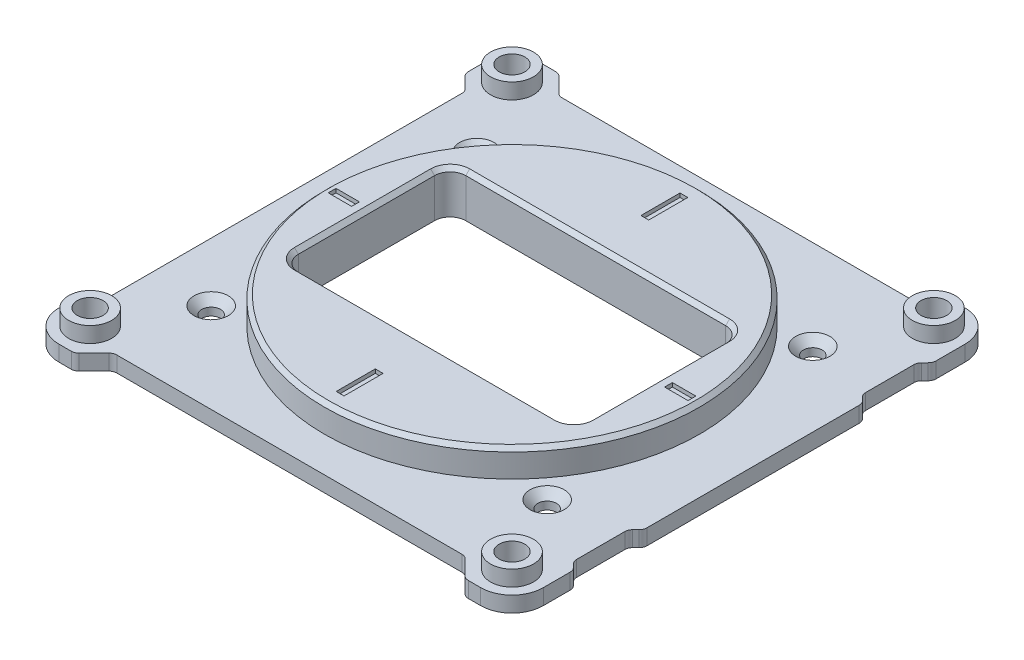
from build123d import *

# Parameters (mm, degrees)
BOSS_EXTRUDE1_DEPTH                            = 2
SKETCH1_R                                      = 24
BOSS_EXTRUDE2_DEPTH                            = 3.5
CUT_EXTRUDE1_REACH                             = 51.284
SKETCH6_R                                      = 2.75
BOSS_EXTRUDE3_DEPTH                            = 2
M4X0_7_TAPPED_HOLE1_D                          = 3.3
M4X0_7_TAPPED_HOLE1_DEPTH                      = 4
M4X0_7_TAPPED_HOLE1_TIP                        = 0.991420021
CSK_FOR_M2_FLAT_HEAD_MACHINE_SCREW1_AT_2_COUNT = 2
CSK_FOR_M2_FLAT_HEAD_MACHINE_SCREW1_AT_2_PITCH = 43
CSK_FOR_M2_FLAT_HEAD_MACHINE_SCREW1_AT_3_COUNT = 2
CSK_FOR_M2_FLAT_HEAD_MACHINE_SCREW1_AT_3_PITCH = 54.817880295
CSK_FOR_M2_FLAT_HEAD_MACHINE_SCREW1_AT_4_COUNT = 2
CSK_FOR_M2_FLAT_HEAD_MACHINE_SCREW1_AT_4_PITCH = 34
SKETCH14_W                                     = 3
SKETCH14_H                                     = 1
SKETCH14_W_2                                   = 1
SKETCH14_H_2                                   = 5
CUT_EXTRUDE2_DEPTH                             = 0.5
CHAMFER1_SIZE                                  = 0.5


with BuildPart() as part:
    # Top Plate Outline → Boss-Extrude1 (new body)
    with BuildSketch(Plane(origin=(0, 0, 0), x_dir=(1, 0, 0), z_dir=(0, 1, 0))):
        with BuildLine():
            Line((17.100061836, 30.232739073), (19.014275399, 32.146952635))
            ThreePointArc((19.014275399, 32.146952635), (19.338698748, 32.363725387), (19.72138218, 32.439845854))
            Line((19.72138218, 32.439845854), (21.307168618, 32.439845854))
            ThreePointArc((21.307168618, 32.439845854), (24.135595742, 31.268272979), (25.307168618, 28.439845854))
            Line((25.307168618, 28.439845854), (25.307168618, 24.714394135))
            ThreePointArc((25.307168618, 24.714394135), (25.23104815, 24.331710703), (25.014275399, 24.007287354))
            Line((25.014275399, 24.007287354), (24.600061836, 23.593073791))
            ThreePointArc((24.600061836, 23.593073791), (24.383289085, 23.268650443), (24.307168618, 22.88596701))
            Line((24.307168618, 22.88596701), (24.307168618, 16.714394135))
            ThreePointArc((24.307168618, 16.714394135), (24.383289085, 16.331710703), (24.600061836, 16.007287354))
            Line((24.600061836, 16.007287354), (25.014275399, 15.593073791))
            ThreePointArc((25.014275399, 15.593073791), (25.23104815, 15.268650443), (25.307168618, 14.88596701))
            Line((25.307168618, 14.88596701), (25.307168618, -12.285605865))
            ThreePointArc((25.307168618, -12.285605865), (25.23104815, -12.668289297), (25.014275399, -12.992712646))
            Line((25.014275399, -12.992712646), (24.600061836, -13.406926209))
            ThreePointArc((24.600061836, -13.406926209), (24.383289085, -13.731349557), (24.307168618, -14.11403299))
            Line((24.307168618, -14.11403299), (24.307168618, -20.285605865))
            ThreePointArc((24.307168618, -20.285605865), (24.383289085, -20.668289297), (24.600061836, -20.992712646))
            Line((24.600061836, -20.992712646), (25.014275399, -21.406926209))
            ThreePointArc((25.014275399, -21.406926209), (25.23104815, -21.731349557), (25.307168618, -22.11403299))
            Line((25.307168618, -22.11403299), (25.307168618, -25.560154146))
            ThreePointArc((25.307168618, -25.560154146), (24.135595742, -28.38858127), (21.307168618, -29.560154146))
            Line((21.307168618, -29.560154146), (19.72138218, -29.560154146))
            ThreePointArc((19.72138218, -29.560154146), (19.338698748, -29.484033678), (19.014275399, -29.267260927))
            Line((19.014275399, -29.267260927), (17.100061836, -27.353047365))
            ThreePointArc((17.100061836, -27.353047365), (16.775638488, -27.136274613), (16.392955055, -27.060154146))
            Line((16.392955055, -27.060154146), (-27.77861782, -27.060154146))
            ThreePointArc((-27.77861782, -27.060154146), (-28.161301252, -27.136274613), (-28.485724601, -27.353047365))
            Line((-28.485724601, -27.353047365), (-30.399938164, -29.267260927))
            ThreePointArc((-30.399938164, -29.267260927), (-30.724361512, -29.484033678), (-31.107044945, -29.560154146))
            Line((-31.107044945, -29.560154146), (-32.692831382, -29.560154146))
            ThreePointArc((-32.692831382, -29.560154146), (-35.521258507, -28.38858127), (-36.692831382, -25.560154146))
            Line((-36.692831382, -25.560154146), (-36.692831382, -23.974367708))
            ThreePointArc((-36.692831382, -23.974367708), (-36.616710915, -23.591684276), (-36.399938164, -23.267260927))
            Line((-36.399938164, -23.267260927), (-34.985724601, -21.853047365))
            ThreePointArc((-34.985724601, -21.853047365), (-34.76895185, -21.528624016), (-34.692831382, -21.145940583))
            Line((-34.692831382, -21.145940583), (-34.692831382, 24.025632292))
            ThreePointArc((-34.692831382, 24.025632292), (-34.76895185, 24.408315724), (-34.985724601, 24.732739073))
            Line((-34.985724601, 24.732739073), (-36.399938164, 26.146952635))
            ThreePointArc((-36.399938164, 26.146952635), (-36.616710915, 26.471375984), (-36.692831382, 26.854059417))
            Line((-36.692831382, 26.854059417), (-36.692831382, 28.439845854))
            ThreePointArc((-36.692831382, 28.439845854), (-35.521258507, 31.268272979), (-32.692831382, 32.439845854))
            Line((-32.692831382, 32.439845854), (-31.107044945, 32.439845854))
            ThreePointArc((-31.107044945, 32.439845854), (-30.724361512, 32.363725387), (-30.399938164, 32.146952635))
            Line((-30.399938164, 32.146952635), (-28.485724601, 30.232739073))
            ThreePointArc((-28.485724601, 30.232739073), (-28.161301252, 30.015966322), (-27.77861782, 29.939845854))
            Line((-27.77861782, 29.939845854), (16.392955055, 29.939845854))
            ThreePointArc((16.392955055, 29.939845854), (16.775638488, 30.015966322), (17.100061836, 30.232739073))
        make_face()
    extrude(amount=BOSS_EXTRUDE1_DEPTH)

    # Sketch1 → Boss-Extrude2 (add)
    with BuildSketch(Plane(origin=(0, 2, 0), x_dir=(1, 0, 0), z_dir=(0, 1, 0))):
        with Locations(Location((-5.692831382, 1.439845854, 0), (0, 0, 270))):
            Circle(SKETCH1_R)
    extrude(amount=BOSS_EXTRUDE2_DEPTH)

    # Sketch5 → Cut-Extrude1 (cut, up to next)
    with BuildSketch(Plane(origin=(0, 5.5, 0), x_dir=(1, 0, 0), z_dir=(0, 1, 0)), mode=Mode.PRIVATE) as cut_extrude1_sk1:
        with BuildLine():
            Line((-22.324092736, 12.156448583), (10.938429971, 12.156448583))
            ThreePointArc((10.938429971, 12.156448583), (12.352643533, 11.570662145), (12.938429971, 10.156448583))
            Line((12.938429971, 10.156448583), (12.938429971, -7.276756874))
            ThreePointArc((12.938429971, -7.276756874), (12.352643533, -8.690970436), (10.938429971, -9.276756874))
            Line((10.938429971, -9.276756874), (-22.324092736, -9.276756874))
            ThreePointArc((-22.324092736, -9.276756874), (-23.738306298, -8.690970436), (-24.324092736, -7.276756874))
            Line((-24.324092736, -7.276756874), (-24.324092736, 10.156448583))
            ThreePointArc((-24.324092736, 10.156448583), (-23.738306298, 11.570662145), (-22.324092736, 12.156448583))
        make_face()
    cut_extrude1_tool1 = extrude(cut_extrude1_sk1.sketch, amount=-CUT_EXTRUDE1_REACH, mode=Mode.PRIVATE) & part.part
    add(cut_extrude1_tool1.solids().sort_by_distance((-5.692831, 5.5, -1.439846))[0], mode=Mode.SUBTRACT)

    # Sketch6 → Boss-Extrude3 (add)
    with BuildSketch(Plane(origin=(0, 2, 0), x_dir=(1, 0, 0), z_dir=(0, 1, 0))):
        with Locations(Location((-32.692831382, 28.439845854, 0), (0, 0, 270))):
            Circle(SKETCH6_R)
        with Locations(Location((21.307168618, 28.439845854, 0), (0, 0, 270))):
            Circle(SKETCH6_R)
        with Locations(Location((21.307168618, -25.560154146, 0), (0, 0, 270))):
            Circle(SKETCH6_R)
        with Locations(Location((-32.692831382, -25.560154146, 0), (0, 0, 270))):
            Circle(SKETCH6_R)
    extrude(amount=BOSS_EXTRUDE3_DEPTH)

    # M4x0.7 Tapped Hole1
    with Locations(Plane(origin=(0, 0, 0), x_dir=(-1, 0, 0), z_dir=(0, -1, 0))):
        with Locations((-21.307168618, 28.439845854), (32.692831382, 28.439845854), (32.692831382, -25.560154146), (-21.307168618, -25.560154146)):
            Hole(M4X0_7_TAPPED_HOLE1_D / 2, depth=M4X0_7_TAPPED_HOLE1_DEPTH)
            with Locations((0, 0, -(M4X0_7_TAPPED_HOLE1_DEPTH + M4X0_7_TAPPED_HOLE1_TIP / 2))):  # 118° drill point
                Cone(0, M4X0_7_TAPPED_HOLE1_D / 2, M4X0_7_TAPPED_HOLE1_TIP, mode=Mode.SUBTRACT)

    # Sketch13 → CSK for M2 Flat Head Machine Screw1 (revolve, cut)
    with BuildSketch(Plane(origin=(-27.192831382, 2, -18.439845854), x_dir=(0, 0, 1), z_dir=(1, 0, 0))):
        Polygon((0, 0), (0, 2), (1.2, 2), (1.2, 1), (2.2, 0), align=None)
    csk_for_m2_flat_head_machine_screw1 = revolve(axis=Axis((-27.192831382, 8.35, -18.439845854), (0, -1, 0)), mode=Mode.SUBTRACT)

    # CSK for M2 Flat Head Machine Screw1 at 2: CSK for M2 Flat Head Machine Screw1 ×2
    with Locations(*[(i * CSK_FOR_M2_FLAT_HEAD_MACHINE_SCREW1_AT_2_PITCH, 0, 0) for i in range(1, CSK_FOR_M2_FLAT_HEAD_MACHINE_SCREW1_AT_2_COUNT)]):
        add(csk_for_m2_flat_head_machine_screw1, mode=Mode.SUBTRACT)

    # CSK for M2 Flat Head Machine Screw1 at 3: CSK for M2 Flat Head Machine Screw1 ×2
    with Locations(*[Vector(0.7844155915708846, 0, 0.6202355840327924) * (i * CSK_FOR_M2_FLAT_HEAD_MACHINE_SCREW1_AT_3_PITCH) for i in range(1, CSK_FOR_M2_FLAT_HEAD_MACHINE_SCREW1_AT_3_COUNT)]):
        add(csk_for_m2_flat_head_machine_screw1, mode=Mode.SUBTRACT)

    # CSK for M2 Flat Head Machine Screw1 at 4: CSK for M2 Flat Head Machine Screw1 ×2
    with Locations(*[(0, 0, i * CSK_FOR_M2_FLAT_HEAD_MACHINE_SCREW1_AT_4_PITCH) for i in range(1, CSK_FOR_M2_FLAT_HEAD_MACHINE_SCREW1_AT_4_COUNT)]):
        add(csk_for_m2_flat_head_machine_screw1, mode=Mode.SUBTRACT)

    # Sketch14 → Cut-Extrude2 (cut)
    with BuildSketch(Plane(origin=(0, 5.5, 0), x_dir=(1, 0, 0), z_dir=(0, 1, 0))):
        with Locations((-27.221917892, 1.439845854)):
            Rectangle(SKETCH14_W, SKETCH14_H)
        with Locations((15.836255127, 1.439845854)):
            Rectangle(SKETCH14_W, SKETCH14_H)
        with Locations((-5.692831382, -18.060154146)):
            Rectangle(SKETCH14_W_2, SKETCH14_H_2)
        with Locations((-5.692831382, 20.939845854)):
            Rectangle(SKETCH14_W_2, SKETCH14_H_2)
    extrude(amount=-CUT_EXTRUDE2_DEPTH, mode=Mode.SUBTRACT)

    # Chamfer1
    chamfer1_edges = [part.edges().sort_by_distance(p)[0] for p in [
        (-5.692831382, 5.5, -25.439845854),
        (-23.738306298, 5.5, 8.690970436),
        (-5.692831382, 5.5, 9.276756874),
        (12.352643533, 5.5, 8.690970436),
        (12.938429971, 5.5, -1.439845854),
        (12.352643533, 5.5, -11.570662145),
        (-5.692831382, 5.5, -12.156448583),
        (-23.738306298, 5.5, -11.570662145),
        (-24.324092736, 5.5, -1.439845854),
    ]]
    chamfer(chamfer1_edges, length=CHAMFER1_SIZE)


solid = part.part
